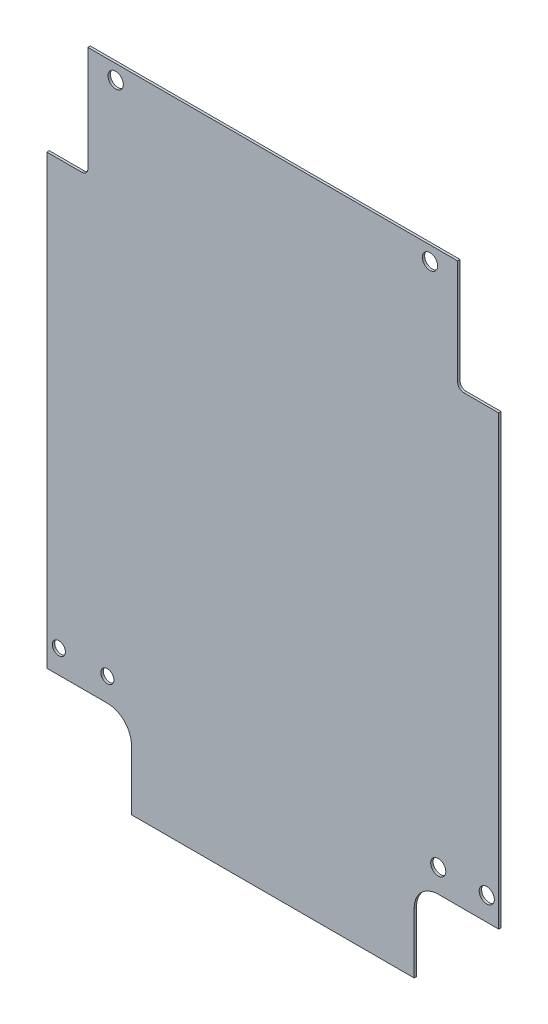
from build123d import *

# Parameters (mm, degrees)
SKETCH1_R      = 2.7
SKETCH1_R_2    = 3.175
SKETCH1_R_3    = 3.125
EXTRUDE1_DEPTH = 1


with BuildPart() as part:
    # Sketch1 → Extrude1 (new body)
    with BuildSketch(Plane.XY):
        with BuildLine():
            Line((76.482, -17.46), (76.482, 26))
            Line((76.482, 26), (-76.5, 26))
            Line((-76.5, 26), (-76.5, -17.46))
            ThreePointArc((-76.5, -17.46), (-77.243948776, -19.256051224), (-79.04, -20))
            Line((-79.04, -20), (-93.5, -20))
            Line((-93.5, -20), (-93.5, -205))
            Line((-93.5, -205), (-68.5, -205))
            ThreePointArc((-68.5, -205), (-61.428932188, -207.928932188), (-58.5, -215))
            Line((-58.5, -215), (-58.5, -240))
            Line((-58.5, -240), (58.5, -240))
            Line((58.5, -240), (58.5, -215))
            ThreePointArc((58.5, -215), (61.428932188, -207.928932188), (68.5, -205))
            Line((68.5, -205), (93.5, -205))
            Line((93.5, -205), (93.5, -20))
            Line((93.5, -20), (79.022, -20))
            ThreePointArc((79.022, -20), (77.225948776, -19.256051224), (76.482, -17.46))
        make_face()
        with Locations((-88.537347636, -195.335160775)):
            Circle(SKETCH1_R, mode=Mode.SUBTRACT)
        with Locations((-68.462172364, -195.335160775)):
            Circle(SKETCH1_R, mode=Mode.SUBTRACT)
        with Locations((-65.0266, 20.02)):
            Circle(SKETCH1_R_2, mode=Mode.SUBTRACT)
        with Locations((65.0266, 20.02)):
            Circle(SKETCH1_R_2, mode=Mode.SUBTRACT)
        with Locations((88.537347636, -195.335160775)):
            Circle(SKETCH1_R_3, mode=Mode.SUBTRACT)
        with Locations((68.462172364, -195.335160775)):
            Circle(SKETCH1_R_3, mode=Mode.SUBTRACT)
    extrude(amount=EXTRUDE1_DEPTH)


solid = part.part
